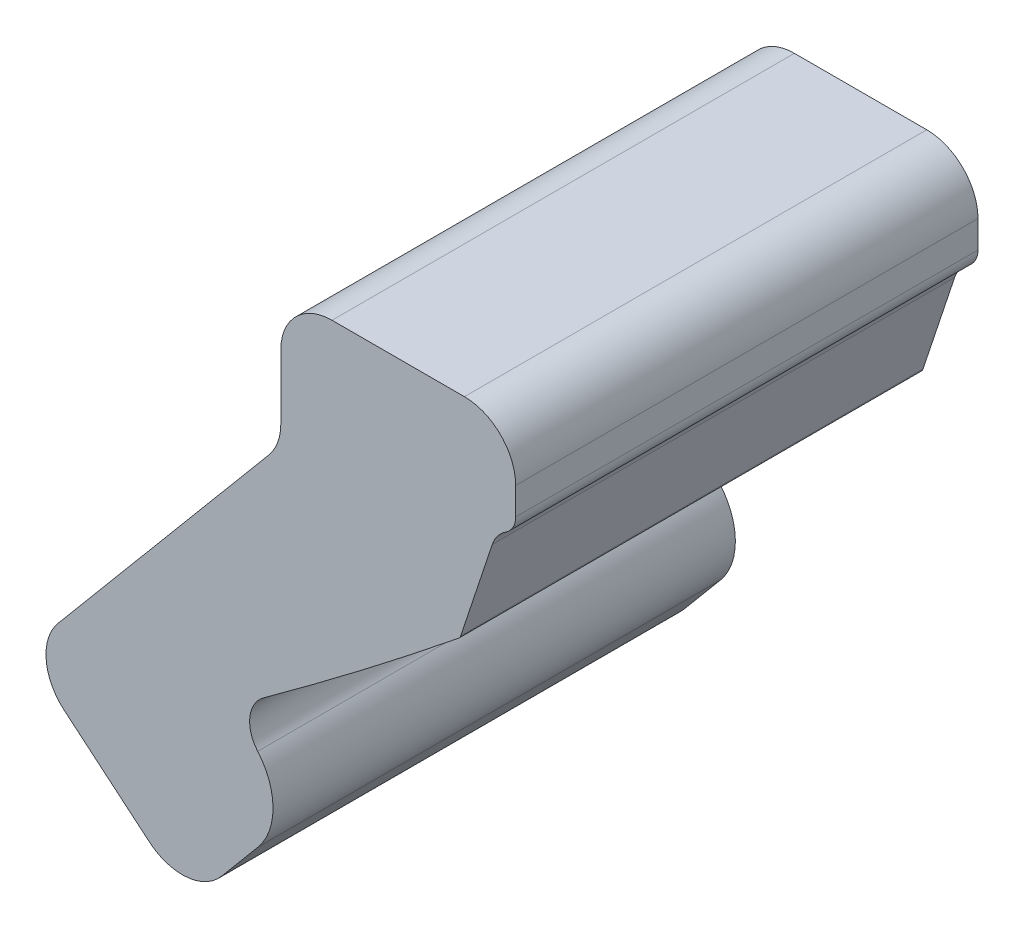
ISO-10303-21;
HEADER;
FILE_DESCRIPTION(('STEP AP214'),'2;1');
FILE_NAME('part.step','',(''),(''),'','','');
FILE_SCHEMA(('AUTOMOTIVE_DESIGN { 1 0 10303 214 1 1 1 1 }'));
ENDSEC;
DATA;
#1=APPLICATION_CONTEXT('core data for automotive mechanical design processes');
#2=APPLICATION_PROTOCOL_DEFINITION('international standard','automotive_design',2000,#1);
#3=PRODUCT_CONTEXT('',#1,'mechanical');
#4=PRODUCT('Part','Part','',(#3));
#5=PRODUCT_RELATED_PRODUCT_CATEGORY('part','',(#4));
#6=PRODUCT_DEFINITION_FORMATION('','',#4);
#7=PRODUCT_DEFINITION_CONTEXT('part definition',#1,'design');
#8=PRODUCT_DEFINITION('design','',#6,#7);
#9=PRODUCT_DEFINITION_SHAPE('','',#8);
#10=(LENGTH_UNIT() NAMED_UNIT(*) SI_UNIT(.MILLI.,.METRE.));
#11=(NAMED_UNIT(*) PLANE_ANGLE_UNIT() SI_UNIT($,.RADIAN.));
#12=(NAMED_UNIT(*) SI_UNIT($,.STERADIAN.) SOLID_ANGLE_UNIT());
#13=UNCERTAINTY_MEASURE_WITH_UNIT(LENGTH_MEASURE(1.E-05),#10,'distance_accuracy_value','');
#14=(GEOMETRIC_REPRESENTATION_CONTEXT(3) GLOBAL_UNCERTAINTY_ASSIGNED_CONTEXT((#13)) GLOBAL_UNIT_ASSIGNED_CONTEXT((#10,
#11,#12)) REPRESENTATION_CONTEXT('',''));
#15=CARTESIAN_POINT('',(0.,0.,0.));
#16=DIRECTION('',(0.,0.,1.));
#17=DIRECTION('',(1.,0.,0.));
#18=AXIS2_PLACEMENT_3D('',#15,#16,#17);
#19=CARTESIAN_POINT('',(0.,0.,3.19999999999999));
#20=DIRECTION('',(0.,0.,1.));
#21=DIRECTION('',(1.,0.,0.));
#22=AXIS2_PLACEMENT_3D('',#19,#20,#21);
#23=PLANE('',#22);
#24=CARTESIAN_POINT('',(-499.622243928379,-70.9858047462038,3.19999999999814));
#25=DIRECTION('',(0.,0.,1.));
#26=DIRECTION('',(1.,0.,0.));
#27=AXIS2_PLACEMENT_3D('',#24,#25,#26);
#28=CIRCLE('',#27,5.01650000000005);
#29=CARTESIAN_POINT('',(-502.564505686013,-66.9227556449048,3.19999999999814));
#30=VERTEX_POINT('',#29);
#31=CARTESIAN_POINT('',(-503.437363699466,-74.243124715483,3.19999999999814));
#32=VERTEX_POINT('',#31);
#33=EDGE_CURVE('E195',#30,#32,#28,.T.);
#34=ORIENTED_EDGE('',*,*,#33,.T.);
#35=CARTESIAN_POINT('',(-510.681261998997,-80.4279094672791,3.19999999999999));
#36=DIRECTION('',(0.,0.,1.));
#37=DIRECTION('',(1.,0.,0.));
#38=AXIS2_PLACEMENT_3D('',#35,#36,#37);
#39=CIRCLE('',#38,9.525);
#40=CARTESIAN_POINT('',(-503.384688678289,-86.5504614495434,3.19999999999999));
#41=VERTEX_POINT('',#40);
#42=EDGE_CURVE('E12',#32,#41,#39,.F.);
#43=ORIENTED_EDGE('',*,*,#42,.T.);
#44=DIRECTION('',(0.64278760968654,0.766044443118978,0.));
#45=VECTOR('',#44,1.);
#46=CARTESIAN_POINT('',(-508.819347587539,-93.0272357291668,3.19999999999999));
#47=LINE('',#46,#45);
#48=CARTESIAN_POINT('',(-508.819347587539,-93.0272357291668,3.19999999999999));
#49=VERTEX_POINT('',#48);
#50=EDGE_CURVE('E261',#49,#41,#47,.T.);
#51=ORIENTED_EDGE('',*,*,#50,.F.);
#52=CARTESIAN_POINT('',(-514.656606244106,-88.1291941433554,3.19999999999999));
#53=DIRECTION('',(0.,0.,1.));
#54=DIRECTION('',(1.,0.,0.));
#55=AXIS2_PLACEMENT_3D('',#52,#53,#54);
#56=CIRCLE('',#55,7.61999999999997);
#57=CARTESIAN_POINT('',(-519.554647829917,-93.9664527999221,3.19999999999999));
#58=VERTEX_POINT('',#57);
#59=EDGE_CURVE('E257',#58,#49,#56,.T.);
#60=ORIENTED_EDGE('',*,*,#59,.F.);
#61=DIRECTION('',(0.766044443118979,-0.642787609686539,0.));
#62=VECTOR('',#61,1.);
#63=CARTESIAN_POINT('',(-532.202041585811,-83.3540293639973,3.19999999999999));
#64=LINE('',#63,#62);
#65=CARTESIAN_POINT('',(-532.202041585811,-83.3540293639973,3.19999999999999));
#66=VERTEX_POINT('',#65);
#67=EDGE_CURVE('E253',#66,#58,#64,.T.);
#68=ORIENTED_EDGE('',*,*,#67,.F.);
#69=CARTESIAN_POINT('',(-527.304,-77.5167707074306,3.19999999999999));
#70=DIRECTION('',(0.,0.,1.));
#71=DIRECTION('',(1.,0.,0.));
#72=AXIS2_PLACEMENT_3D('',#69,#70,#71);
#73=CIRCLE('',#72,7.62000000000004);
#74=CARTESIAN_POINT('',(-533.141258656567,-72.6187291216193,3.19999999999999));
#75=VERTEX_POINT('',#74);
#76=EDGE_CURVE('E249',#75,#66,#73,.T.);
#77=ORIENTED_EDGE('',*,*,#76,.F.);
#78=DIRECTION('',(-0.642787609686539,-0.766044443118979,0.));
#79=VECTOR('',#78,1.);
#80=CARTESIAN_POINT('',(-501.781741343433,-35.2459117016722,3.19999999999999));
#81=LINE('',#80,#79);
#82=CARTESIAN_POINT('',(-501.781741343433,-35.2459117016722,3.19999999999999));
#83=VERTEX_POINT('',#82);
#84=EDGE_CURVE('E245',#83,#75,#81,.T.);
#85=ORIENTED_EDGE('',*,*,#84,.F.);
#86=CARTESIAN_POINT('',(-507.619,-30.3478701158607,3.19999999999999));
#87=DIRECTION('',(0.,0.,1.));
#88=DIRECTION('',(1.,0.,0.));
#89=AXIS2_PLACEMENT_3D('',#86,#87,#88);
#90=CIRCLE('',#89,7.61999999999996);
#91=CARTESIAN_POINT('',(-499.999,-30.3478701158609,3.19999999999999));
#92=VERTEX_POINT('',#91);
#93=EDGE_CURVE('E241',#92,#83,#90,.F.);
#94=ORIENTED_EDGE('',*,*,#93,.F.);
#95=DIRECTION('',(0.,-1.,0.));
#96=VECTOR('',#95,1.);
#97=CARTESIAN_POINT('',(-499.999,-20.8191941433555,3.19999999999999));
#98=LINE('',#97,#96);
#99=CARTESIAN_POINT('',(-499.999,-20.8191941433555,3.19999999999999));
#100=VERTEX_POINT('',#99);
#101=EDGE_CURVE('E237',#100,#92,#98,.T.);
#102=ORIENTED_EDGE('',*,*,#101,.F.);
#103=CARTESIAN_POINT('',(-492.379,-20.8191941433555,3.19999999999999));
#104=DIRECTION('',(0.,0.,1.));
#105=DIRECTION('',(1.,0.,0.));
#106=AXIS2_PLACEMENT_3D('',#103,#104,#105);
#107=CIRCLE('',#106,7.61999999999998);
#108=CARTESIAN_POINT('',(-492.379,-13.1991941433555,3.19999999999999));
#109=VERTEX_POINT('',#108);
#110=EDGE_CURVE('E228',#109,#100,#107,.T.);
#111=ORIENTED_EDGE('',*,*,#110,.F.);
#112=DIRECTION('',(-1.,0.,0.));
#113=VECTOR('',#112,1.);
#114=CARTESIAN_POINT('',(-472.694,-13.1991941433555,3.19999999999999));
#115=LINE('',#114,#113);
#116=CARTESIAN_POINT('',(-472.694,-13.1991941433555,3.19999999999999));
#117=VERTEX_POINT('',#116);
#118=EDGE_CURVE('E346',#117,#109,#115,.T.);
#119=ORIENTED_EDGE('',*,*,#118,.F.);
#120=CARTESIAN_POINT('',(-472.694,-20.8191941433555,3.19999999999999));
#121=DIRECTION('',(0.,0.,1.));
#122=DIRECTION('',(1.,0.,0.));
#123=AXIS2_PLACEMENT_3D('',#120,#121,#122);
#124=CIRCLE('',#123,7.61999999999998);
#125=CARTESIAN_POINT('',(-465.074,-20.8191941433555,3.19999999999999));
#126=VERTEX_POINT('',#125);
#127=EDGE_CURVE('E268',#126,#117,#124,.T.);
#128=ORIENTED_EDGE('',*,*,#127,.F.);
#129=DIRECTION('',(0.,1.,0.));
#130=VECTOR('',#129,1.);
#131=CARTESIAN_POINT('',(-465.074,-38.1201073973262,3.19999999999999));
#132=LINE('',#131,#130);
#133=CARTESIAN_POINT('',(-465.074,-24.8750685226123,3.19999999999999));
#134=VERTEX_POINT('',#133);
#135=EDGE_CURVE('E265',#134,#126,#132,.T.);
#136=ORIENTED_EDGE('',*,*,#135,.F.);
#137=CARTESIAN_POINT('',(-468.249,-24.8750685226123,3.19999999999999));
#138=DIRECTION('',(0.,0.,1.));
#139=DIRECTION('',(1.,0.,0.));
#140=AXIS2_PLACEMENT_3D('',#137,#138,#139);
#141=CIRCLE('',#140,3.175);
#142=CARTESIAN_POINT('',(-466.522735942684,-27.5397706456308,3.19999999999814));
#143=VERTEX_POINT('',#142);
#144=EDGE_CURVE('E179',#134,#143,#141,.F.);
#145=ORIENTED_EDGE('',*,*,#144,.T.);
#146=CARTESIAN_POINT('',(-463.795238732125,-31.75,3.19999999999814));
#147=DIRECTION('',(0.,0.,1.));
#148=DIRECTION('',(1.,0.,0.));
#149=AXIS2_PLACEMENT_3D('',#146,#147,#148);
#150=CIRCLE('',#149,5.01649999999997);
#151=CARTESIAN_POINT('',(-468.555523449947,-30.1672929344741,3.19999999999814));
#152=VERTEX_POINT('',#151);
#153=EDGE_CURVE('E173',#143,#152,#150,.T.);
#154=ORIENTED_EDGE('',*,*,#153,.T.);
#155=DIRECTION('',(-0.31550026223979,-0.948925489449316,0.));
#156=VECTOR('',#155,1.);
#157=CARTESIAN_POINT('',(-468.555523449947,-30.1672929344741,3.19999999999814));
#158=LINE('',#157,#156);
#159=CARTESIAN_POINT('',(-473.249529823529,-44.2853867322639,3.19999999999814));
#160=VERTEX_POINT('',#159);
#161=EDGE_CURVE('E177',#152,#160,#158,.T.);
#162=ORIENTED_EDGE('',*,*,#161,.T.);
#163=CARTESIAN_POINT('',(-474.213638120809,-43.9648384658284,3.19999999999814));
#164=DIRECTION('',(0.,0.,-1.));
#165=DIRECTION('',(1.,0.,0.));
#166=AXIS2_PLACEMENT_3D('',#163,#164,#165);
#167=CIRCLE('',#166,1.01599999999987);
#168=CARTESIAN_POINT('',(-473.575646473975,-44.7555486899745,3.19999999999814));
#169=VERTEX_POINT('',#168);
#170=EDGE_CURVE('E200',#160,#169,#167,.T.);
#171=ORIENTED_EDGE('',*,*,#170,.T.);
#172=CARTESIAN_POINT('',(-912.977322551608,499.827439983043,3.19999999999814));
#173=DIRECTION('',(0.,0.,-1.));
#174=DIRECTION('',(1.,0.,0.));
#175=AXIS2_PLACEMENT_3D('',#172,#173,#174);
#176=CIRCLE('',#175,699.745999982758);
#177=EDGE_CURVE('E204',#169,#30,#176,.T.);
#178=ORIENTED_EDGE('',*,*,#177,.T.);
#179=EDGE_LOOP('',(#34,#43,#51,#60,#68,#77,#85,#94,#102,#111,#119,#128,#136,#145,#154,#162,#171,#178));
#180=FACE_BOUND('',#179,.T.);
#181=ADVANCED_FACE('F47',(#180),#23,.F.);
#182=CARTESIAN_POINT('',(-472.694,-20.8191941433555,-24.4348));
#183=DIRECTION('',(0.,0.,1.));
#184=DIRECTION('',(1.,0.,0.));
#185=AXIS2_PLACEMENT_3D('',#182,#183,#184);
#186=CYLINDRICAL_SURFACE('',#185,7.61999999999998);
#187=DIRECTION('',(0.,0.,1.));
#188=VECTOR('',#187,1.);
#189=CARTESIAN_POINT('',(-465.074,-20.8191941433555,-24.4348));
#190=LINE('',#189,#188);
#191=CARTESIAN_POINT('',(-465.074,-20.8191941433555,71.9582));
#192=VERTEX_POINT('',#191);
#193=EDGE_CURVE('E343',#126,#192,#190,.T.);
#194=ORIENTED_EDGE('',*,*,#193,.F.);
#195=ORIENTED_EDGE('',*,*,#127,.T.);
#196=DIRECTION('',(0.,0.,1.));
#197=VECTOR('',#196,1.);
#198=CARTESIAN_POINT('',(-472.694,-13.1991941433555,-24.4348));
#199=LINE('',#198,#197);
#200=CARTESIAN_POINT('',(-472.694,-13.1991941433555,71.9582));
#201=VERTEX_POINT('',#200);
#202=EDGE_CURVE('E315',#117,#201,#199,.T.);
#203=ORIENTED_EDGE('',*,*,#202,.T.);
#204=CARTESIAN_POINT('',(-472.694,-20.8191941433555,71.9582));
#205=DIRECTION('',(0.,0.,-1.));
#206=DIRECTION('',(1.,0.,0.));
#207=AXIS2_PLACEMENT_3D('',#204,#205,#206);
#208=CIRCLE('',#207,7.61999999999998);
#209=EDGE_CURVE('E272',#201,#192,#208,.T.);
#210=ORIENTED_EDGE('',*,*,#209,.T.);
#211=EDGE_LOOP('',(#194,#195,#203,#210));
#212=FACE_BOUND('',#211,.T.);
#213=ADVANCED_FACE('F461',(#212),#186,.T.);
#214=CARTESIAN_POINT('',(-465.074,-38.1201073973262,-24.4348));
#215=DIRECTION('',(-1.,0.,0.));
#216=DIRECTION('',(0.,-1.,0.));
#217=AXIS2_PLACEMENT_3D('',#214,#215,#216);
#218=PLANE('',#217);
#219=DIRECTION('',(0.,-1.,0.));
#220=VECTOR('',#219,1.);
#221=CARTESIAN_POINT('',(-465.074,-38.1201073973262,71.9582));
#222=LINE('',#221,#220);
#223=CARTESIAN_POINT('',(-465.074,-24.8750685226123,71.9582));
#224=VERTEX_POINT('',#223);
#225=EDGE_CURVE('E276',#192,#224,#222,.T.);
#226=ORIENTED_EDGE('',*,*,#225,.T.);
#227=DIRECTION('',(0.,0.,1.));
#228=VECTOR('',#227,1.);
#229=CARTESIAN_POINT('',(-465.074,-24.8750685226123,-24.4348));
#230=LINE('',#229,#228);
#231=EDGE_CURVE('E352',#224,#134,#230,.F.);
#232=ORIENTED_EDGE('',*,*,#231,.T.);
#233=ORIENTED_EDGE('',*,*,#135,.T.);
#234=ORIENTED_EDGE('',*,*,#193,.T.);
#235=EDGE_LOOP('',(#226,#232,#233,#234));
#236=FACE_BOUND('',#235,.T.);
#237=ADVANCED_FACE('F463',(#236),#218,.F.);
#238=CARTESIAN_POINT('',(-508.819347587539,-93.0272357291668,-24.4348));
#239=DIRECTION('',(-0.766044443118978,0.64278760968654,0.));
#240=DIRECTION('',(-0.64278760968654,-0.766044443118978,0.));
#241=AXIS2_PLACEMENT_3D('',#238,#239,#240);
#242=PLANE('',#241);
#243=ORIENTED_EDGE('',*,*,#50,.T.);
#244=DIRECTION('',(0.,0.,1.));
#245=VECTOR('',#244,1.);
#246=CARTESIAN_POINT('',(-503.384688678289,-86.5504614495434,-24.4348));
#247=LINE('',#246,#245);
#248=CARTESIAN_POINT('',(-503.384688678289,-86.5504614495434,71.9582));
#249=VERTEX_POINT('',#248);
#250=EDGE_CURVE('E364',#41,#249,#247,.T.);
#251=ORIENTED_EDGE('',*,*,#250,.T.);
#252=DIRECTION('',(-0.64278760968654,-0.766044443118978,0.));
#253=VECTOR('',#252,1.);
#254=CARTESIAN_POINT('',(-508.819347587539,-93.0272357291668,71.9582));
#255=LINE('',#254,#253);
#256=CARTESIAN_POINT('',(-508.819347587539,-93.0272357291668,71.9582));
#257=VERTEX_POINT('',#256);
#258=EDGE_CURVE('E280',#249,#257,#255,.T.);
#259=ORIENTED_EDGE('',*,*,#258,.T.);
#260=DIRECTION('',(0.,0.,1.));
#261=VECTOR('',#260,1.);
#262=CARTESIAN_POINT('',(-508.819347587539,-93.0272357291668,-24.4348));
#263=LINE('',#262,#261);
#264=EDGE_CURVE('E339',#49,#257,#263,.T.);
#265=ORIENTED_EDGE('',*,*,#264,.F.);
#266=EDGE_LOOP('',(#243,#251,#259,#265));
#267=FACE_BOUND('',#266,.T.);
#268=ADVANCED_FACE('F420',(#267),#242,.F.);
#269=CARTESIAN_POINT('',(-514.656606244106,-88.1291941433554,-24.4348));
#270=DIRECTION('',(0.,0.,1.));
#271=DIRECTION('',(1.,0.,0.));
#272=AXIS2_PLACEMENT_3D('',#269,#270,#271);
#273=CYLINDRICAL_SURFACE('',#272,7.61999999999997);
#274=DIRECTION('',(0.,0.,1.));
#275=VECTOR('',#274,1.);
#276=CARTESIAN_POINT('',(-519.554647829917,-93.966452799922,-24.4348));
#277=LINE('',#276,#275);
#278=CARTESIAN_POINT('',(-519.554647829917,-93.966452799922,71.9582));
#279=VERTEX_POINT('',#278);
#280=EDGE_CURVE('E336',#58,#279,#277,.T.);
#281=ORIENTED_EDGE('',*,*,#280,.F.);
#282=ORIENTED_EDGE('',*,*,#59,.T.);
#283=ORIENTED_EDGE('',*,*,#264,.T.);
#284=CARTESIAN_POINT('',(-514.656606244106,-88.1291941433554,71.9582));
#285=DIRECTION('',(0.,0.,-1.));
#286=DIRECTION('',(1.,0.,0.));
#287=AXIS2_PLACEMENT_3D('',#284,#285,#286);
#288=CIRCLE('',#287,7.61999999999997);
#289=EDGE_CURVE('E283',#257,#279,#288,.T.);
#290=ORIENTED_EDGE('',*,*,#289,.T.);
#291=EDGE_LOOP('',(#281,#282,#283,#290));
#292=FACE_BOUND('',#291,.T.);
#293=ADVANCED_FACE('F430',(#292),#273,.T.);
#294=CARTESIAN_POINT('',(-532.202041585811,-83.3540293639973,-24.4348));
#295=DIRECTION('',(0.642787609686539,0.766044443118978,0.));
#296=DIRECTION('',(-0.766044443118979,0.642787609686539,0.));
#297=AXIS2_PLACEMENT_3D('',#294,#295,#296);
#298=PLANE('',#297);
#299=DIRECTION('',(0.,0.,1.));
#300=VECTOR('',#299,1.);
#301=CARTESIAN_POINT('',(-532.202041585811,-83.3540293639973,-24.4348));
#302=LINE('',#301,#300);
#303=CARTESIAN_POINT('',(-532.202041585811,-83.3540293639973,71.9582));
#304=VERTEX_POINT('',#303);
#305=EDGE_CURVE('E333',#66,#304,#302,.T.);
#306=ORIENTED_EDGE('',*,*,#305,.F.);
#307=ORIENTED_EDGE('',*,*,#67,.T.);
#308=ORIENTED_EDGE('',*,*,#280,.T.);
#309=DIRECTION('',(-0.766044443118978,0.642787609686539,0.));
#310=VECTOR('',#309,1.);
#311=CARTESIAN_POINT('',(-532.202041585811,-83.3540293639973,71.9582));
#312=LINE('',#311,#310);
#313=EDGE_CURVE('E287',#279,#304,#312,.T.);
#314=ORIENTED_EDGE('',*,*,#313,.T.);
#315=EDGE_LOOP('',(#306,#307,#308,#314));
#316=FACE_BOUND('',#315,.T.);
#317=ADVANCED_FACE('F433',(#316),#298,.F.);
#318=CARTESIAN_POINT('',(-527.304,-77.5167707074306,-24.4348));
#319=DIRECTION('',(0.,0.,1.));
#320=DIRECTION('',(1.,0.,0.));
#321=AXIS2_PLACEMENT_3D('',#318,#319,#320);
#322=CYLINDRICAL_SURFACE('',#321,7.62000000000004);
#323=DIRECTION('',(0.,0.,1.));
#324=VECTOR('',#323,1.);
#325=CARTESIAN_POINT('',(-533.141258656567,-72.6187291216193,-24.4348));
#326=LINE('',#325,#324);
#327=CARTESIAN_POINT('',(-533.141258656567,-72.6187291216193,71.9582));
#328=VERTEX_POINT('',#327);
#329=EDGE_CURVE('E330',#75,#328,#326,.T.);
#330=ORIENTED_EDGE('',*,*,#329,.F.);
#331=ORIENTED_EDGE('',*,*,#76,.T.);
#332=ORIENTED_EDGE('',*,*,#305,.T.);
#333=CARTESIAN_POINT('',(-527.304,-77.5167707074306,71.9582));
#334=DIRECTION('',(0.,0.,-1.));
#335=DIRECTION('',(1.,0.,0.));
#336=AXIS2_PLACEMENT_3D('',#333,#334,#335);
#337=CIRCLE('',#336,7.62000000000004);
#338=EDGE_CURVE('E291',#304,#328,#337,.T.);
#339=ORIENTED_EDGE('',*,*,#338,.T.);
#340=EDGE_LOOP('',(#330,#331,#332,#339));
#341=FACE_BOUND('',#340,.T.);
#342=ADVANCED_FACE('F436',(#341),#322,.T.);
#343=CARTESIAN_POINT('',(-501.781741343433,-35.2459117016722,-24.4348));
#344=DIRECTION('',(0.766044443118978,-0.642787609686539,0.));
#345=DIRECTION('',(0.642787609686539,0.766044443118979,0.));
#346=AXIS2_PLACEMENT_3D('',#343,#344,#345);
#347=PLANE('',#346);
#348=DIRECTION('',(0.,0.,1.));
#349=VECTOR('',#348,1.);
#350=CARTESIAN_POINT('',(-501.781741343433,-35.2459117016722,-24.4348));
#351=LINE('',#350,#349);
#352=CARTESIAN_POINT('',(-501.781741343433,-35.2459117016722,71.9582));
#353=VERTEX_POINT('',#352);
#354=EDGE_CURVE('E327',#83,#353,#351,.T.);
#355=ORIENTED_EDGE('',*,*,#354,.F.);
#356=ORIENTED_EDGE('',*,*,#84,.T.);
#357=ORIENTED_EDGE('',*,*,#329,.T.);
#358=DIRECTION('',(0.642787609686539,0.766044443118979,0.));
#359=VECTOR('',#358,1.);
#360=CARTESIAN_POINT('',(-501.781741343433,-35.2459117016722,71.9582));
#361=LINE('',#360,#359);
#362=EDGE_CURVE('E295',#328,#353,#361,.T.);
#363=ORIENTED_EDGE('',*,*,#362,.T.);
#364=EDGE_LOOP('',(#355,#356,#357,#363));
#365=FACE_BOUND('',#364,.T.);
#366=ADVANCED_FACE('F440',(#365),#347,.F.);
#367=CARTESIAN_POINT('',(-507.619,-30.3478701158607,-24.4348));
#368=DIRECTION('',(0.,0.,1.));
#369=DIRECTION('',(1.,0.,0.));
#370=AXIS2_PLACEMENT_3D('',#367,#368,#369);
#371=CYLINDRICAL_SURFACE('',#370,7.61999999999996);
#372=DIRECTION('',(0.,0.,1.));
#373=VECTOR('',#372,1.);
#374=CARTESIAN_POINT('',(-499.999,-30.3478701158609,-24.4348));
#375=LINE('',#374,#373);
#376=CARTESIAN_POINT('',(-499.999,-30.3478701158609,71.9582));
#377=VERTEX_POINT('',#376);
#378=EDGE_CURVE('E324',#92,#377,#375,.T.);
#379=ORIENTED_EDGE('',*,*,#378,.F.);
#380=ORIENTED_EDGE('',*,*,#93,.T.);
#381=ORIENTED_EDGE('',*,*,#354,.T.);
#382=CARTESIAN_POINT('',(-507.619,-30.3478701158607,71.9582));
#383=DIRECTION('',(0.,0.,1.));
#384=DIRECTION('',(-1.,0.,0.));
#385=AXIS2_PLACEMENT_3D('',#382,#383,#384);
#386=CIRCLE('',#385,7.61999999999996);
#387=EDGE_CURVE('E299',#353,#377,#386,.T.);
#388=ORIENTED_EDGE('',*,*,#387,.T.);
#389=EDGE_LOOP('',(#379,#380,#381,#388));
#390=FACE_BOUND('',#389,.T.);
#391=ADVANCED_FACE('F444',(#390),#371,.F.);
#392=CARTESIAN_POINT('',(-499.999,-20.8191941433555,-24.4348));
#393=DIRECTION('',(1.,0.,0.));
#394=DIRECTION('',(0.,1.,0.));
#395=AXIS2_PLACEMENT_3D('',#392,#393,#394);
#396=PLANE('',#395);
#397=DIRECTION('',(0.,0.,1.));
#398=VECTOR('',#397,1.);
#399=CARTESIAN_POINT('',(-499.999,-20.8191941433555,-24.4348));
#400=LINE('',#399,#398);
#401=CARTESIAN_POINT('',(-499.999,-20.8191941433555,71.9582));
#402=VERTEX_POINT('',#401);
#403=EDGE_CURVE('E321',#100,#402,#400,.T.);
#404=ORIENTED_EDGE('',*,*,#403,.F.);
#405=ORIENTED_EDGE('',*,*,#101,.T.);
#406=ORIENTED_EDGE('',*,*,#378,.T.);
#407=DIRECTION('',(0.,1.,0.));
#408=VECTOR('',#407,1.);
#409=CARTESIAN_POINT('',(-499.999,-20.8191941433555,71.9582));
#410=LINE('',#409,#408);
#411=EDGE_CURVE('E303',#377,#402,#410,.T.);
#412=ORIENTED_EDGE('',*,*,#411,.T.);
#413=EDGE_LOOP('',(#404,#405,#406,#412));
#414=FACE_BOUND('',#413,.T.);
#415=ADVANCED_FACE('F448',(#414),#396,.F.);
#416=CARTESIAN_POINT('',(-492.379,-20.8191941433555,-24.4348));
#417=DIRECTION('',(0.,0.,1.));
#418=DIRECTION('',(1.,0.,0.));
#419=AXIS2_PLACEMENT_3D('',#416,#417,#418);
#420=CYLINDRICAL_SURFACE('',#419,7.61999999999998);
#421=DIRECTION('',(0.,0.,1.));
#422=VECTOR('',#421,1.);
#423=CARTESIAN_POINT('',(-492.379,-13.1991941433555,-24.4348));
#424=LINE('',#423,#422);
#425=CARTESIAN_POINT('',(-492.379,-13.1991941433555,71.9582));
#426=VERTEX_POINT('',#425);
#427=EDGE_CURVE('E318',#109,#426,#424,.T.);
#428=ORIENTED_EDGE('',*,*,#427,.F.);
#429=ORIENTED_EDGE('',*,*,#110,.T.);
#430=ORIENTED_EDGE('',*,*,#403,.T.);
#431=CARTESIAN_POINT('',(-492.379,-20.8191941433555,71.9582));
#432=DIRECTION('',(0.,0.,-1.));
#433=DIRECTION('',(-1.,0.,0.));
#434=AXIS2_PLACEMENT_3D('',#431,#432,#433);
#435=CIRCLE('',#434,7.61999999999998);
#436=EDGE_CURVE('E307',#402,#426,#435,.T.);
#437=ORIENTED_EDGE('',*,*,#436,.T.);
#438=EDGE_LOOP('',(#428,#429,#430,#437));
#439=FACE_BOUND('',#438,.T.);
#440=ADVANCED_FACE('F452',(#439),#420,.T.);
#441=CARTESIAN_POINT('',(-472.694,-13.1991941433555,-24.4348));
#442=DIRECTION('',(0.,-1.,0.));
#443=DIRECTION('',(0.,0.,-1.));
#444=AXIS2_PLACEMENT_3D('',#441,#442,#443);
#445=PLANE('',#444);
#446=ORIENTED_EDGE('',*,*,#202,.F.);
#447=ORIENTED_EDGE('',*,*,#118,.T.);
#448=ORIENTED_EDGE('',*,*,#427,.T.);
#449=DIRECTION('',(1.,0.,0.));
#450=VECTOR('',#449,1.);
#451=CARTESIAN_POINT('',(-472.694,-13.1991941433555,71.9582));
#452=LINE('',#451,#450);
#453=EDGE_CURVE('E311',#426,#201,#452,.T.);
#454=ORIENTED_EDGE('',*,*,#453,.T.);
#455=EDGE_LOOP('',(#446,#447,#448,#454));
#456=FACE_BOUND('',#455,.T.);
#457=ADVANCED_FACE('F457',(#456),#445,.F.);
#458=CARTESIAN_POINT('',(-472.694,-20.8191941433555,71.9582));
#459=DIRECTION('',(0.,0.,1.));
#460=DIRECTION('',(1.,0.,0.));
#461=AXIS2_PLACEMENT_3D('',#458,#459,#460);
#462=PLANE('',#461);
#463=ORIENTED_EDGE('',*,*,#258,.F.);
#464=CARTESIAN_POINT('',(-510.681261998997,-80.4279094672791,71.9582));
#465=DIRECTION('',(0.,0.,1.));
#466=DIRECTION('',(1.,0.,0.));
#467=AXIS2_PLACEMENT_3D('',#464,#465,#466);
#468=CIRCLE('',#467,9.525);
#469=CARTESIAN_POINT('',(-503.437363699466,-74.243124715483,71.9582));
#470=VERTEX_POINT('',#469);
#471=EDGE_CURVE('E70',#249,#470,#468,.T.);
#472=ORIENTED_EDGE('',*,*,#471,.T.);
#473=CARTESIAN_POINT('',(-499.622243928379,-70.9858047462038,71.9582));
#474=DIRECTION('',(0.,0.,1.));
#475=DIRECTION('',(1.,0.,0.));
#476=AXIS2_PLACEMENT_3D('',#473,#474,#475);
#477=CIRCLE('',#476,5.01650000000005);
#478=CARTESIAN_POINT('',(-502.564505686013,-66.9227556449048,71.9582));
#479=VERTEX_POINT('',#478);
#480=EDGE_CURVE('E183',#479,#470,#477,.T.);
#481=ORIENTED_EDGE('',*,*,#480,.F.);
#482=CARTESIAN_POINT('',(-912.977322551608,499.827439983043,71.9582));
#483=DIRECTION('',(0.,0.,-1.));
#484=DIRECTION('',(1.,0.,0.));
#485=AXIS2_PLACEMENT_3D('',#482,#483,#484);
#486=CIRCLE('',#485,699.745999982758);
#487=CARTESIAN_POINT('',(-473.575646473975,-44.7555486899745,71.9582));
#488=VERTEX_POINT('',#487);
#489=EDGE_CURVE('E219',#488,#479,#486,.T.);
#490=ORIENTED_EDGE('',*,*,#489,.F.);
#491=CARTESIAN_POINT('',(-474.213638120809,-43.9648384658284,71.9582));
#492=DIRECTION('',(0.,0.,-1.));
#493=DIRECTION('',(1.,0.,0.));
#494=AXIS2_PLACEMENT_3D('',#491,#492,#493);
#495=CIRCLE('',#494,1.01599999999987);
#496=CARTESIAN_POINT('',(-473.249529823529,-44.2853867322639,71.9582));
#497=VERTEX_POINT('',#496);
#498=EDGE_CURVE('E215',#497,#488,#495,.T.);
#499=ORIENTED_EDGE('',*,*,#498,.F.);
#500=DIRECTION('',(-0.31550026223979,-0.948925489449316,0.));
#501=VECTOR('',#500,1.);
#502=CARTESIAN_POINT('',(-468.555523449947,-30.1672929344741,71.9582));
#503=LINE('',#502,#501);
#504=CARTESIAN_POINT('',(-468.555523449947,-30.1672929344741,71.9582));
#505=VERTEX_POINT('',#504);
#506=EDGE_CURVE('E212',#505,#497,#503,.T.);
#507=ORIENTED_EDGE('',*,*,#506,.F.);
#508=CARTESIAN_POINT('',(-463.795238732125,-31.75,71.9582));
#509=DIRECTION('',(0.,0.,1.));
#510=DIRECTION('',(1.,0.,0.));
#511=AXIS2_PLACEMENT_3D('',#508,#509,#510);
#512=CIRCLE('',#511,5.01649999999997);
#513=CARTESIAN_POINT('',(-466.522735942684,-27.5397706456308,71.9582));
#514=VERTEX_POINT('',#513);
#515=EDGE_CURVE('E189',#514,#505,#512,.T.);
#516=ORIENTED_EDGE('',*,*,#515,.F.);
#517=CARTESIAN_POINT('',(-468.249,-24.8750685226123,71.9582));
#518=DIRECTION('',(0.,0.,1.));
#519=DIRECTION('',(1.,0.,0.));
#520=AXIS2_PLACEMENT_3D('',#517,#518,#519);
#521=CIRCLE('',#520,3.175);
#522=EDGE_CURVE('E361',#514,#224,#521,.T.);
#523=ORIENTED_EDGE('',*,*,#522,.T.);
#524=ORIENTED_EDGE('',*,*,#225,.F.);
#525=ORIENTED_EDGE('',*,*,#209,.F.);
#526=ORIENTED_EDGE('',*,*,#453,.F.);
#527=ORIENTED_EDGE('',*,*,#436,.F.);
#528=ORIENTED_EDGE('',*,*,#411,.F.);
#529=ORIENTED_EDGE('',*,*,#387,.F.);
#530=ORIENTED_EDGE('',*,*,#362,.F.);
#531=ORIENTED_EDGE('',*,*,#338,.F.);
#532=ORIENTED_EDGE('',*,*,#313,.F.);
#533=ORIENTED_EDGE('',*,*,#289,.F.);
#534=EDGE_LOOP('',(#463,#472,#481,#490,#499,#507,#516,#523,#524,#525,#526,#527,#528,#529,#530,
#531,#532,#533));
#535=FACE_BOUND('',#534,.T.);
#536=ADVANCED_FACE('F425',(#535),#462,.T.);
#537=CARTESIAN_POINT('',(-463.795238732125,-31.75,3.19999999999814));
#538=DIRECTION('',(0.,0.,1.));
#539=DIRECTION('',(1.,0.,0.));
#540=AXIS2_PLACEMENT_3D('',#537,#538,#539);
#541=CYLINDRICAL_SURFACE('',#540,5.01649999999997);
#542=ORIENTED_EDGE('',*,*,#153,.F.);
#543=DIRECTION('',(0.,0.,1.));
#544=VECTOR('',#543,1.);
#545=CARTESIAN_POINT('',(-466.522735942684,-27.5397706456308,3.19999999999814));
#546=LINE('',#545,#544);
#547=EDGE_CURVE('E358',#143,#514,#546,.T.);
#548=ORIENTED_EDGE('',*,*,#547,.T.);
#549=ORIENTED_EDGE('',*,*,#515,.T.);
#550=DIRECTION('',(0.,0.,1.));
#551=VECTOR('',#550,1.);
#552=CARTESIAN_POINT('',(-468.555523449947,-30.1672929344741,3.19999999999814));
#553=LINE('',#552,#551);
#554=EDGE_CURVE('E186',#152,#505,#553,.T.);
#555=ORIENTED_EDGE('',*,*,#554,.F.);
#556=EDGE_LOOP('',(#542,#548,#549,#555));
#557=FACE_BOUND('',#556,.T.);
#558=ADVANCED_FACE('F187',(#557),#541,.F.);
#559=CARTESIAN_POINT('',(-499.622243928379,-70.9858047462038,3.19999999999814));
#560=DIRECTION('',(0.,0.,1.));
#561=DIRECTION('',(1.,0.,0.));
#562=AXIS2_PLACEMENT_3D('',#559,#560,#561);
#563=CYLINDRICAL_SURFACE('',#562,5.01650000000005);
#564=ORIENTED_EDGE('',*,*,#480,.T.);
#565=DIRECTION('',(0.,0.,1.));
#566=VECTOR('',#565,1.);
#567=CARTESIAN_POINT('',(-503.437363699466,-74.243124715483,3.19999999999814));
#568=LINE('',#567,#566);
#569=EDGE_CURVE('E56',#470,#32,#568,.F.);
#570=ORIENTED_EDGE('',*,*,#569,.T.);
#571=ORIENTED_EDGE('',*,*,#33,.F.);
#572=DIRECTION('',(0.,0.,1.));
#573=VECTOR('',#572,1.);
#574=CARTESIAN_POINT('',(-502.564505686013,-66.9227556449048,3.19999999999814));
#575=LINE('',#574,#573);
#576=EDGE_CURVE('E225',#30,#479,#575,.T.);
#577=ORIENTED_EDGE('',*,*,#576,.T.);
#578=EDGE_LOOP('',(#564,#570,#571,#577));
#579=FACE_BOUND('',#578,.T.);
#580=ADVANCED_FACE('F476',(#579),#563,.F.);
#581=CARTESIAN_POINT('',(-912.977322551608,499.827439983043,3.19999999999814));
#582=DIRECTION('',(0.,0.,1.));
#583=DIRECTION('',(1.,0.,0.));
#584=AXIS2_PLACEMENT_3D('',#581,#582,#583);
#585=CYLINDRICAL_SURFACE('',#584,699.745999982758);
#586=ORIENTED_EDGE('',*,*,#489,.T.);
#587=ORIENTED_EDGE('',*,*,#576,.F.);
#588=ORIENTED_EDGE('',*,*,#177,.F.);
#589=DIRECTION('',(0.,0.,1.));
#590=VECTOR('',#589,1.);
#591=CARTESIAN_POINT('',(-473.575646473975,-44.7555486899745,3.19999999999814));
#592=LINE('',#591,#590);
#593=EDGE_CURVE('E229',#169,#488,#592,.T.);
#594=ORIENTED_EDGE('',*,*,#593,.T.);
#595=EDGE_LOOP('',(#586,#587,#588,#594));
#596=FACE_BOUND('',#595,.T.);
#597=ADVANCED_FACE('F475',(#596),#585,.T.);
#598=CARTESIAN_POINT('',(-474.213638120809,-43.9648384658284,3.19999999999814));
#599=DIRECTION('',(0.,0.,1.));
#600=DIRECTION('',(1.,0.,0.));
#601=AXIS2_PLACEMENT_3D('',#598,#599,#600);
#602=CYLINDRICAL_SURFACE('',#601,1.01599999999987);
#603=ORIENTED_EDGE('',*,*,#498,.T.);
#604=ORIENTED_EDGE('',*,*,#593,.F.);
#605=ORIENTED_EDGE('',*,*,#170,.F.);
#606=DIRECTION('',(0.,0.,1.));
#607=VECTOR('',#606,1.);
#608=CARTESIAN_POINT('',(-473.249529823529,-44.2853867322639,3.19999999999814));
#609=LINE('',#608,#607);
#610=EDGE_CURVE('E194',#160,#497,#609,.T.);
#611=ORIENTED_EDGE('',*,*,#610,.T.);
#612=EDGE_LOOP('',(#603,#604,#605,#611));
#613=FACE_BOUND('',#612,.T.);
#614=ADVANCED_FACE('F472',(#613),#602,.T.);
#615=CARTESIAN_POINT('',(-468.555523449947,-30.1672929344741,3.19999999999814));
#616=DIRECTION('',(-0.948925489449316,0.31550026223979,0.));
#617=DIRECTION('',(-0.31550026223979,-0.948925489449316,0.));
#618=AXIS2_PLACEMENT_3D('',#615,#616,#617);
#619=PLANE('',#618);
#620=ORIENTED_EDGE('',*,*,#506,.T.);
#621=ORIENTED_EDGE('',*,*,#610,.F.);
#622=ORIENTED_EDGE('',*,*,#161,.F.);
#623=ORIENTED_EDGE('',*,*,#554,.T.);
#624=EDGE_LOOP('',(#620,#621,#622,#623));
#625=FACE_BOUND('',#624,.T.);
#626=ADVANCED_FACE('F197',(#625),#619,.F.);
#627=CARTESIAN_POINT('',(-468.249,-24.8750685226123,3.19999999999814));
#628=DIRECTION('',(0.,0.,1.));
#629=DIRECTION('',(1.,0.,0.));
#630=AXIS2_PLACEMENT_3D('',#627,#628,#629);
#631=CYLINDRICAL_SURFACE('',#630,3.175);
#632=ORIENTED_EDGE('',*,*,#522,.F.);
#633=ORIENTED_EDGE('',*,*,#547,.F.);
#634=ORIENTED_EDGE('',*,*,#144,.F.);
#635=ORIENTED_EDGE('',*,*,#231,.F.);
#636=EDGE_LOOP('',(#632,#633,#634,#635));
#637=FACE_BOUND('',#636,.T.);
#638=ADVANCED_FACE('F468',(#637),#631,.T.);
#639=CARTESIAN_POINT('',(-510.681261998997,-80.4279094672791,3.19999999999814));
#640=DIRECTION('',(0.,0.,1.));
#641=DIRECTION('',(1.,0.,0.));
#642=AXIS2_PLACEMENT_3D('',#639,#640,#641);
#643=CYLINDRICAL_SURFACE('',#642,9.525);
#644=ORIENTED_EDGE('',*,*,#42,.F.);
#645=ORIENTED_EDGE('',*,*,#569,.F.);
#646=ORIENTED_EDGE('',*,*,#471,.F.);
#647=ORIENTED_EDGE('',*,*,#250,.F.);
#648=EDGE_LOOP('',(#644,#645,#646,#647));
#649=FACE_BOUND('',#648,.T.);
#650=ADVANCED_FACE('F49',(#649),#643,.T.);
#651=CLOSED_SHELL('',(#181,#213,#237,#268,#293,#317,#342,#366,#391,#415,#440,#457,#536,#558,
#580,#597,#614,#626,#638,#650));
#652=MANIFOLD_SOLID_BREP('B2',#651);
#653=ADVANCED_BREP_SHAPE_REPRESENTATION('',(#18,#652),#14);
#654=SHAPE_DEFINITION_REPRESENTATION(#9,#653);
ENDSEC;
END-ISO-10303-21;
